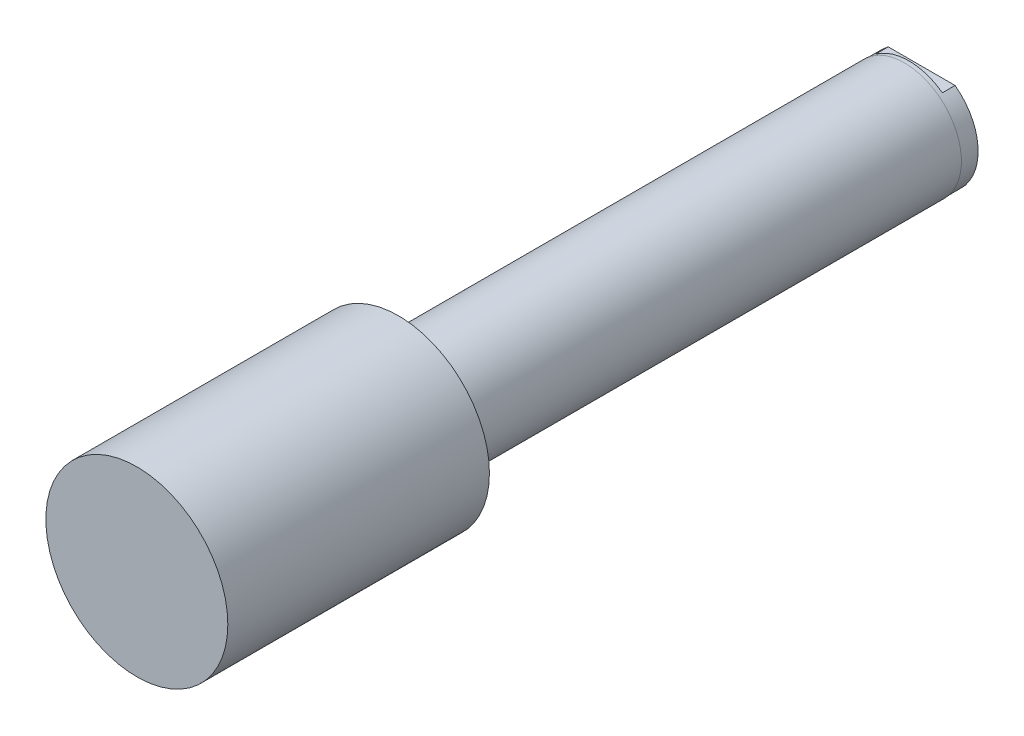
ISO-10303-21;
HEADER;
FILE_DESCRIPTION(('STEP AP214'),'2;1');
FILE_NAME('part.step','',(''),(''),'','','');
FILE_SCHEMA(('AUTOMOTIVE_DESIGN { 1 0 10303 214 1 1 1 1 }'));
ENDSEC;
DATA;
#1=APPLICATION_CONTEXT('core data for automotive mechanical design processes');
#2=APPLICATION_PROTOCOL_DEFINITION('international standard','automotive_design',2000,#1);
#3=PRODUCT_CONTEXT('',#1,'mechanical');
#4=PRODUCT('Part','Part','',(#3));
#5=PRODUCT_RELATED_PRODUCT_CATEGORY('part','',(#4));
#6=PRODUCT_DEFINITION_FORMATION('','',#4);
#7=PRODUCT_DEFINITION_CONTEXT('part definition',#1,'design');
#8=PRODUCT_DEFINITION('design','',#6,#7);
#9=PRODUCT_DEFINITION_SHAPE('','',#8);
#10=(LENGTH_UNIT() NAMED_UNIT(*) SI_UNIT(.MILLI.,.METRE.));
#11=(NAMED_UNIT(*) PLANE_ANGLE_UNIT() SI_UNIT($,.RADIAN.));
#12=(NAMED_UNIT(*) SI_UNIT($,.STERADIAN.) SOLID_ANGLE_UNIT());
#13=UNCERTAINTY_MEASURE_WITH_UNIT(LENGTH_MEASURE(1.E-05),#10,'distance_accuracy_value','');
#14=(GEOMETRIC_REPRESENTATION_CONTEXT(3) GLOBAL_UNCERTAINTY_ASSIGNED_CONTEXT((#13)) GLOBAL_UNIT_ASSIGNED_CONTEXT((#10,
#11,#12)) REPRESENTATION_CONTEXT('',''));
#15=CARTESIAN_POINT('',(0.,0.,0.));
#16=DIRECTION('',(0.,0.,1.));
#17=DIRECTION('',(1.,0.,0.));
#18=AXIS2_PLACEMENT_3D('',#15,#16,#17);
#19=CARTESIAN_POINT('',(0.,0.,214.2998));
#20=DIRECTION('',(0.,0.,1.));
#21=DIRECTION('',(1.,0.,0.));
#22=AXIS2_PLACEMENT_3D('',#19,#20,#21);
#23=PLANE('',#22);
#24=CARTESIAN_POINT('',(0.,0.,214.2998));
#25=DIRECTION('',(0.,0.,1.));
#26=DIRECTION('',(1.,0.,0.));
#27=AXIS2_PLACEMENT_3D('',#24,#25,#26);
#28=CIRCLE('',#27,25.4);
#29=CARTESIAN_POINT('',(25.4,0.,214.2998));
#30=VERTEX_POINT('',#29);
#31=EDGE_CURVE('E104',#30,#30,#28,.T.);
#32=ORIENTED_EDGE('',*,*,#31,.T.);
#33=EDGE_LOOP('',(#32));
#34=FACE_BOUND('',#33,.T.);
#35=ADVANCED_FACE('F16',(#34),#23,.T.);
#36=CARTESIAN_POINT('',(0.,0.,214.2998));
#37=DIRECTION('',(0.,0.,-1.));
#38=DIRECTION('',(-1.,0.,0.));
#39=AXIS2_PLACEMENT_3D('',#36,#37,#38);
#40=CYLINDRICAL_SURFACE('',#39,25.4);
#41=ORIENTED_EDGE('',*,*,#31,.F.);
#42=EDGE_LOOP('',(#41));
#43=FACE_BOUND('',#42,.T.);
#44=CARTESIAN_POINT('',(0.,0.,141.2748));
#45=DIRECTION('',(0.,0.,1.));
#46=DIRECTION('',(1.,0.,0.));
#47=AXIS2_PLACEMENT_3D('',#44,#45,#46);
#48=CIRCLE('',#47,25.4);
#49=CARTESIAN_POINT('',(25.4,0.,141.2748));
#50=VERTEX_POINT('',#49);
#51=EDGE_CURVE('E101',#50,#50,#48,.T.);
#52=ORIENTED_EDGE('',*,*,#51,.T.);
#53=EDGE_LOOP('',(#52));
#54=FACE_BOUND('',#53,.T.);
#55=ADVANCED_FACE('F165',(#43,#54),#40,.T.);
#56=CARTESIAN_POINT('',(0.,0.,141.2748));
#57=DIRECTION('',(0.,0.,1.));
#58=DIRECTION('',(1.,0.,0.));
#59=AXIS2_PLACEMENT_3D('',#56,#57,#58);
#60=PLANE('',#59);
#61=CARTESIAN_POINT('',(0.,0.,141.2748));
#62=DIRECTION('',(0.,0.,1.));
#63=DIRECTION('',(1.,0.,0.));
#64=AXIS2_PLACEMENT_3D('',#61,#62,#63);
#65=CIRCLE('',#64,15.875);
#66=CARTESIAN_POINT('',(15.875,0.,141.2748));
#67=VERTEX_POINT('',#66);
#68=EDGE_CURVE('E109',#67,#67,#65,.F.);
#69=ORIENTED_EDGE('',*,*,#68,.F.);
#70=EDGE_LOOP('',(#69));
#71=FACE_BOUND('',#70,.T.);
#72=ORIENTED_EDGE('',*,*,#51,.F.);
#73=EDGE_LOOP('',(#72));
#74=FACE_BOUND('',#73,.T.);
#75=ADVANCED_FACE('F161',(#71,#74),#60,.F.);
#76=CARTESIAN_POINT('',(0.,0.,141.2748));
#77=DIRECTION('',(0.,0.,-1.));
#78=DIRECTION('',(-1.,0.,0.));
#79=AXIS2_PLACEMENT_3D('',#76,#77,#78);
#80=CYLINDRICAL_SURFACE('',#79,15.875);
#81=CARTESIAN_POINT('',(0.,0.,0.));
#82=DIRECTION('',(0.,0.,-1.));
#83=DIRECTION('',(-1.,0.,0.));
#84=AXIS2_PLACEMENT_3D('',#81,#82,#83);
#85=CIRCLE('',#84,15.875);
#86=CARTESIAN_POINT('',(-15.875,0.,0.));
#87=VERTEX_POINT('',#86);
#88=EDGE_CURVE('E25',#87,#87,#85,.T.);
#89=ORIENTED_EDGE('',*,*,#88,.F.);
#90=EDGE_LOOP('',(#89));
#91=FACE_BOUND('',#90,.T.);
#92=ORIENTED_EDGE('',*,*,#68,.T.);
#93=EDGE_LOOP('',(#92));
#94=FACE_BOUND('',#93,.T.);
#95=ADVANCED_FACE('F144',(#91,#94),#80,.T.);
#96=CARTESIAN_POINT('',(0.,0.,0.));
#97=DIRECTION('',(0.,0.,-1.));
#98=DIRECTION('',(-1.,0.,0.));
#99=AXIS2_PLACEMENT_3D('',#96,#97,#98);
#100=PLANE('',#99);
#101=ORIENTED_EDGE('',*,*,#88,.T.);
#102=EDGE_LOOP('',(#101));
#103=FACE_BOUND('',#102,.T.);
#104=CARTESIAN_POINT('',(0.,0.,0.));
#105=DIRECTION('',(0.,0.,-1.));
#106=DIRECTION('',(0.,1.,0.));
#107=AXIS2_PLACEMENT_3D('',#104,#105,#106);
#108=CIRCLE('',#107,15.7607);
#109=CARTESIAN_POINT('',(0.,15.7607,0.));
#110=VERTEX_POINT('',#109);
#111=EDGE_CURVE('E10',#110,#110,#108,.T.);
#112=ORIENTED_EDGE('',*,*,#111,.F.);
#113=EDGE_LOOP('',(#112));
#114=FACE_BOUND('',#113,.T.);
#115=ADVANCED_FACE('F148',(#103,#114),#100,.T.);
#116=CARTESIAN_POINT('',(0.,0.,27.7368));
#117=DIRECTION('',(0.,0.,-1.));
#118=DIRECTION('',(-1.,0.,0.));
#119=AXIS2_PLACEMENT_3D('',#116,#117,#118);
#120=CONICAL_SURFACE('',#119,4.96062,1.02974425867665);
#121=CARTESIAN_POINT('',(0.,0.,30.7174412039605));
#122=VERTEX_POINT('',#121);
#123=VERTEX_LOOP('',#122);
#124=FACE_BOUND('',#123,.T.);
#125=CARTESIAN_POINT('',(0.,0.,27.7368));
#126=DIRECTION('',(0.,0.,-1.));
#127=DIRECTION('',(-1.,0.,0.));
#128=AXIS2_PLACEMENT_3D('',#125,#126,#127);
#129=CIRCLE('',#128,4.96062);
#130=CARTESIAN_POINT('',(-4.96062,0.,27.7368));
#131=VERTEX_POINT('',#130);
#132=EDGE_CURVE('E92',#131,#131,#129,.T.);
#133=ORIENTED_EDGE('',*,*,#132,.T.);
#134=EDGE_LOOP('',(#133));
#135=FACE_BOUND('',#134,.T.);
#136=ADVANCED_FACE('F131',(#124,#135),#120,.F.);
#137=CARTESIAN_POINT('',(0.,0.,-4.7752));
#138=DIRECTION('',(0.,0.,-1.));
#139=DIRECTION('',(-1.,0.,0.));
#140=AXIS2_PLACEMENT_3D('',#137,#138,#139);
#141=CYLINDRICAL_SURFACE('',#140,4.96062);
#142=ORIENTED_EDGE('',*,*,#132,.F.);
#143=EDGE_LOOP('',(#142));
#144=FACE_BOUND('',#143,.T.);
#145=CARTESIAN_POINT('',(0.,0.,-4.7752));
#146=DIRECTION('',(0.,0.,-1.));
#147=DIRECTION('',(-1.,0.,0.));
#148=AXIS2_PLACEMENT_3D('',#145,#146,#147);
#149=CIRCLE('',#148,4.96062);
#150=CARTESIAN_POINT('',(-4.96062,0.,-4.7752));
#151=VERTEX_POINT('',#150);
#152=EDGE_CURVE('E95',#151,#151,#149,.T.);
#153=ORIENTED_EDGE('',*,*,#152,.T.);
#154=EDGE_LOOP('',(#153));
#155=FACE_BOUND('',#154,.T.);
#156=ADVANCED_FACE('F122',(#144,#155),#141,.F.);
#157=CARTESIAN_POINT('',(0.,0.,-1.2192));
#158=DIRECTION('',(0.,0.,-1.));
#159=DIRECTION('',(-1.,0.,0.));
#160=AXIS2_PLACEMENT_3D('',#157,#158,#159);
#161=PLANE('',#160);
#162=CARTESIAN_POINT('',(0.,0.,-1.2192));
#163=DIRECTION('',(0.,0.,-1.));
#164=DIRECTION('',(-1.,0.,0.));
#165=AXIS2_PLACEMENT_3D('',#162,#163,#164);
#166=CIRCLE('',#165,15.7607);
#167=CARTESIAN_POINT('',(9.33325583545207,-12.7,-1.2192));
#168=VERTEX_POINT('',#167);
#169=CARTESIAN_POINT('',(-9.33325583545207,-12.7,-1.2192));
#170=VERTEX_POINT('',#169);
#171=EDGE_CURVE('E65',#168,#170,#166,.T.);
#172=ORIENTED_EDGE('',*,*,#171,.T.);
#173=DIRECTION('',(1.,0.,0.));
#174=VECTOR('',#173,1.);
#175=CARTESIAN_POINT('',(9.33325583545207,-12.7,-1.2192));
#176=LINE('',#175,#174);
#177=EDGE_CURVE('E67',#170,#168,#176,.T.);
#178=ORIENTED_EDGE('',*,*,#177,.T.);
#179=EDGE_LOOP('',(#172,#178));
#180=FACE_BOUND('',#179,.T.);
#181=ADVANCED_FACE('F66',(#180),#161,.T.);
#182=CARTESIAN_POINT('',(0.,0.,-1.2192));
#183=DIRECTION('',(0.,0.,-1.));
#184=DIRECTION('',(-1.,0.,0.));
#185=AXIS2_PLACEMENT_3D('',#182,#183,#184);
#186=PLANE('',#185);
#187=CARTESIAN_POINT('',(0.,0.,-1.2192));
#188=DIRECTION('',(0.,0.,-1.));
#189=DIRECTION('',(-1.,0.,0.));
#190=AXIS2_PLACEMENT_3D('',#187,#188,#189);
#191=CIRCLE('',#190,15.7607);
#192=CARTESIAN_POINT('',(-9.33325583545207,12.7,-1.2192));
#193=VERTEX_POINT('',#192);
#194=CARTESIAN_POINT('',(9.33325583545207,12.7,-1.2192));
#195=VERTEX_POINT('',#194);
#196=EDGE_CURVE('E84',#193,#195,#191,.T.);
#197=ORIENTED_EDGE('',*,*,#196,.T.);
#198=DIRECTION('',(-1.,0.,0.));
#199=VECTOR('',#198,1.);
#200=CARTESIAN_POINT('',(9.33325583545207,12.7,-1.2192));
#201=LINE('',#200,#199);
#202=EDGE_CURVE('E86',#195,#193,#201,.T.);
#203=ORIENTED_EDGE('',*,*,#202,.T.);
#204=EDGE_LOOP('',(#197,#203));
#205=FACE_BOUND('',#204,.T.);
#206=ADVANCED_FACE('F117',(#205),#186,.T.);
#207=CARTESIAN_POINT('',(9.33325583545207,12.7,-1.2192));
#208=DIRECTION('',(0.,-1.,0.));
#209=DIRECTION('',(0.,0.,1.));
#210=AXIS2_PLACEMENT_3D('',#207,#208,#209);
#211=PLANE('',#210);
#212=DIRECTION('',(-1.,0.,0.));
#213=VECTOR('',#212,1.);
#214=CARTESIAN_POINT('',(9.33325583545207,12.7,-4.7752));
#215=LINE('',#214,#213);
#216=CARTESIAN_POINT('',(9.33325583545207,12.7,-4.7752));
#217=VERTEX_POINT('',#216);
#218=CARTESIAN_POINT('',(-9.33325583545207,12.7,-4.7752));
#219=VERTEX_POINT('',#218);
#220=EDGE_CURVE('E80',#217,#219,#215,.T.);
#221=ORIENTED_EDGE('',*,*,#220,.T.);
#222=DIRECTION('',(0.,0.,-1.));
#223=VECTOR('',#222,1.);
#224=CARTESIAN_POINT('',(-9.33325583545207,12.7,-1.2192));
#225=LINE('',#224,#223);
#226=EDGE_CURVE('E90',#193,#219,#225,.T.);
#227=ORIENTED_EDGE('',*,*,#226,.F.);
#228=ORIENTED_EDGE('',*,*,#202,.F.);
#229=DIRECTION('',(0.,0.,-1.));
#230=VECTOR('',#229,1.);
#231=CARTESIAN_POINT('',(9.33325583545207,12.7,-1.2192));
#232=LINE('',#231,#230);
#233=EDGE_CURVE('E41',#195,#217,#232,.T.);
#234=ORIENTED_EDGE('',*,*,#233,.T.);
#235=EDGE_LOOP('',(#221,#227,#228,#234));
#236=FACE_BOUND('',#235,.T.);
#237=ADVANCED_FACE('F118',(#236),#211,.F.);
#238=CARTESIAN_POINT('',(0.,0.,-4.7752));
#239=DIRECTION('',(0.,0.,-1.));
#240=DIRECTION('',(-1.,0.,0.));
#241=AXIS2_PLACEMENT_3D('',#238,#239,#240);
#242=PLANE('',#241);
#243=DIRECTION('',(1.,0.,0.));
#244=VECTOR('',#243,1.);
#245=CARTESIAN_POINT('',(9.33325583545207,-12.7,-4.7752));
#246=LINE('',#245,#244);
#247=CARTESIAN_POINT('',(-9.33325583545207,-12.7,-4.7752));
#248=VERTEX_POINT('',#247);
#249=CARTESIAN_POINT('',(9.33325583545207,-12.7,-4.7752));
#250=VERTEX_POINT('',#249);
#251=EDGE_CURVE('E70',#248,#250,#246,.T.);
#252=ORIENTED_EDGE('',*,*,#251,.F.);
#253=CARTESIAN_POINT('',(0.,0.,-4.7752));
#254=DIRECTION('',(0.,0.,-1.));
#255=DIRECTION('',(-1.,0.,0.));
#256=AXIS2_PLACEMENT_3D('',#253,#254,#255);
#257=CIRCLE('',#256,15.7607);
#258=EDGE_CURVE('E78',#248,#219,#257,.T.);
#259=ORIENTED_EDGE('',*,*,#258,.T.);
#260=ORIENTED_EDGE('',*,*,#220,.F.);
#261=EDGE_CURVE('E20',#217,#250,#257,.T.);
#262=ORIENTED_EDGE('',*,*,#261,.T.);
#263=EDGE_LOOP('',(#252,#259,#260,#262));
#264=FACE_BOUND('',#263,.T.);
#265=ORIENTED_EDGE('',*,*,#152,.F.);
#266=EDGE_LOOP('',(#265));
#267=FACE_BOUND('',#266,.T.);
#268=ADVANCED_FACE('F119',(#264,#267),#242,.T.);
#269=CARTESIAN_POINT('',(9.33325583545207,-12.7,-1.2192));
#270=DIRECTION('',(0.,1.,0.));
#271=DIRECTION('',(0.,0.,-1.));
#272=AXIS2_PLACEMENT_3D('',#269,#270,#271);
#273=PLANE('',#272);
#274=ORIENTED_EDGE('',*,*,#251,.T.);
#275=DIRECTION('',(0.,0.,-1.));
#276=VECTOR('',#275,1.);
#277=CARTESIAN_POINT('',(9.33325583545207,-12.7,-1.2192));
#278=LINE('',#277,#276);
#279=EDGE_CURVE('E73',#168,#250,#278,.T.);
#280=ORIENTED_EDGE('',*,*,#279,.F.);
#281=ORIENTED_EDGE('',*,*,#177,.F.);
#282=DIRECTION('',(0.,0.,-1.));
#283=VECTOR('',#282,1.);
#284=CARTESIAN_POINT('',(-9.33325583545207,-12.7,-1.2192));
#285=LINE('',#284,#283);
#286=EDGE_CURVE('E33',#170,#248,#285,.T.);
#287=ORIENTED_EDGE('',*,*,#286,.T.);
#288=EDGE_LOOP('',(#274,#280,#281,#287));
#289=FACE_BOUND('',#288,.T.);
#290=ADVANCED_FACE('F72',(#289),#273,.F.);
#291=CARTESIAN_POINT('',(0.,0.,0.));
#292=DIRECTION('',(0.,0.,-1.));
#293=DIRECTION('',(-1.,0.,0.));
#294=AXIS2_PLACEMENT_3D('',#291,#292,#293);
#295=CYLINDRICAL_SURFACE('',#294,15.7607);
#296=ORIENTED_EDGE('',*,*,#279,.T.);
#297=ORIENTED_EDGE('',*,*,#261,.F.);
#298=ORIENTED_EDGE('',*,*,#233,.F.);
#299=ORIENTED_EDGE('',*,*,#196,.F.);
#300=ORIENTED_EDGE('',*,*,#226,.T.);
#301=ORIENTED_EDGE('',*,*,#258,.F.);
#302=ORIENTED_EDGE('',*,*,#286,.F.);
#303=ORIENTED_EDGE('',*,*,#171,.F.);
#304=EDGE_LOOP('',(#296,#297,#298,#299,#300,#301,#302,#303));
#305=FACE_BOUND('',#304,.T.);
#306=ORIENTED_EDGE('',*,*,#111,.T.);
#307=EDGE_LOOP('',(#306));
#308=FACE_BOUND('',#307,.T.);
#309=ADVANCED_FACE('F18',(#305,#308),#295,.T.);
#310=CLOSED_SHELL('',(#35,#55,#75,#95,#115,#136,#156,#181,#206,#237,#268,#290,#309));
#311=MANIFOLD_SOLID_BREP('B1',#310);
#312=ADVANCED_BREP_SHAPE_REPRESENTATION('',(#18,#311),#14);
#313=SHAPE_DEFINITION_REPRESENTATION(#9,#312);
ENDSEC;
END-ISO-10303-21;
